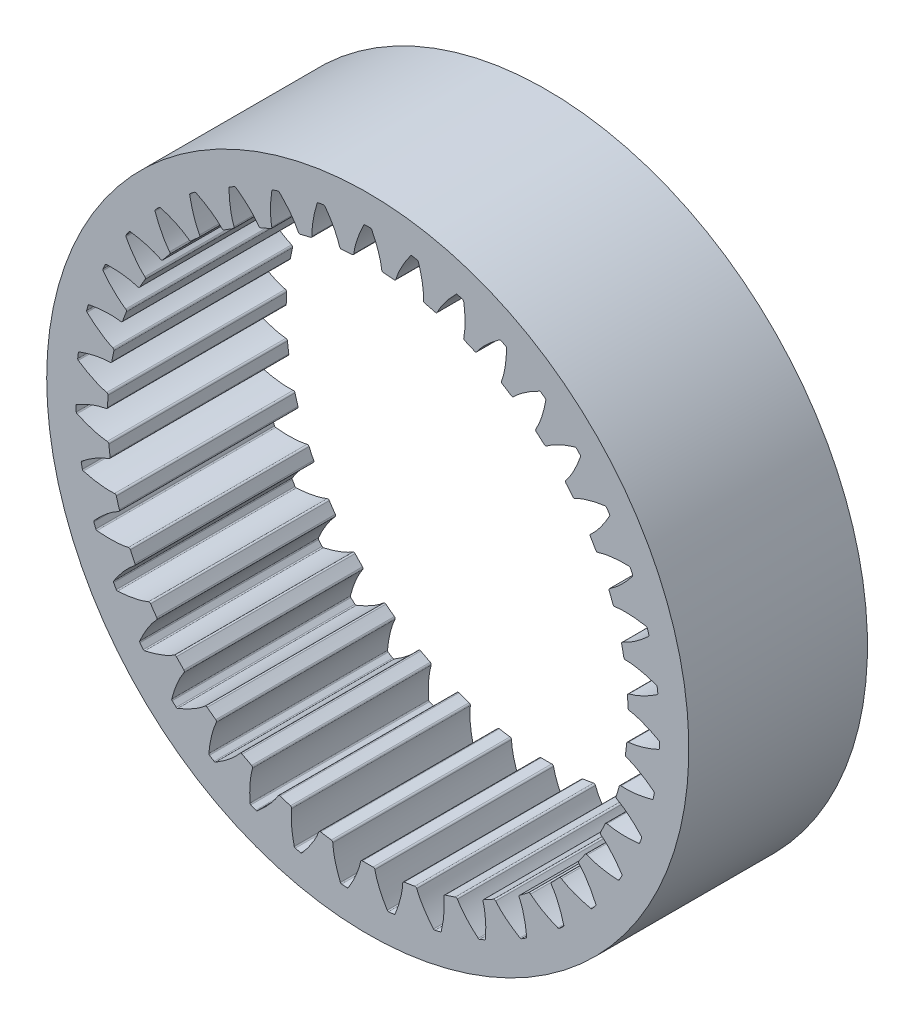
from build123d import *

# Parameters (mm, degrees)
SKETCH5_R              = 22.825
SKETCH5_R_2            = 18.5
RING_GEAR_BLANK_DEPTH  = 6.35
FIRST_TOOTH_DEPTH      = 33.898081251
TIP_RADIUS_R           = 0.125
ROOT_FILLET_R          = 0.1
TEETH_COUNT            = 39
TIP_RADIUS_OF_TEETH_R  = 0.125
ROOT_FILLET_OF_TEETH_R = 0.1


with BuildPart() as part:
    # Sketch5 → Ring Gear Blank (new, symmetric)
    with BuildSketch(Plane.XY):
        with Locations(Location((0, 0, 0), (0, 0, 180))):
            Circle(SKETCH5_R)
        with Locations(Location((0, 0, 0), (0, 0, 180))):
            Circle(SKETCH5_R_2, mode=Mode.SUBTRACT)
    extrude(amount=RING_GEAR_BLANK_DEPTH, both=True)

    # Sketch2 → First Tooth (cut, symmetric)
    with BuildSketch(Plane.XY):
        with BuildLine():
            ThreePointArc((0.254107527, 20.748444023), (0, 20.75), (-0.254107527, 20.748444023))
            add(Edge.make_bspline(
                [(-0.254107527, 20.748444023), (-0.310558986, 20.638981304), (-0.392132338, 20.473179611), (-0.494039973, 20.248906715), (-0.566854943, 20.079104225), (-0.635842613, 19.907709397), (-0.700758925, 19.734729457), (-0.76131836, 19.560173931), (-0.817179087, 19.384055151), (-0.867923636, 19.206390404), (-0.913013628, 19.027200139), (-0.951759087, 18.846525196), (-0.983058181, 18.664381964), (-1.005550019, 18.480971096), (-1.014718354, 18.296009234), (-0.999342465, 18.111683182), (-0.990543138, 17.927186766), (-0.979981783, 17.742735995), (-0.96989198, 17.558273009), (-0.81125654, 14.693390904), (-0.664745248, 11.889769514), (-0.505313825, 9.148057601)],
                knots=[0, 0, 0, 0, 0.031449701, 0.047174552, 0.062899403, 0.078624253, 0.094349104, 0.110073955, 0.125798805, 0.141523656, 0.157248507, 0.172973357, 0.188698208, 0.204423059, 0.220147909, 0.23587276, 0.251597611, 0.267322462, 0.283047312, 0.298772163, 1, 1, 1, 1], degree=3))
            ThreePointArc((-0.505313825, 9.148057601), (0, -9.162003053), (0.505313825, 9.148057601))
            add(Edge.make_bspline(
                [(0.254107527, 20.748444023), (0.310558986, 20.638981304), (0.392132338, 20.473179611), (0.494039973, 20.248906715), (0.566854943, 20.079104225), (0.635842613, 19.907709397), (0.700758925, 19.734729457), (0.76131836, 19.560173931), (0.817179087, 19.384055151), (0.867923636, 19.206390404), (0.913013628, 19.027200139), (0.951759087, 18.846525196), (0.983058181, 18.664381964), (1.005550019, 18.480971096), (1.014718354, 18.296009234), (0.999342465, 18.111683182), (0.990543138, 17.927186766), (0.979981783, 17.742735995), (0.96989198, 17.558273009), (0.81125654, 14.693390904), (0.664745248, 11.889769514), (0.505313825, 9.148057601)],
                knots=[0, 0, 0, 0, 0.031449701, 0.047174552, 0.062899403, 0.078624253, 0.094349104, 0.110073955, 0.125798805, 0.141523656, 0.157248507, 0.172973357, 0.188698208, 0.204423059, 0.220147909, 0.23587276, 0.251597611, 0.267322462, 0.283047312, 0.298772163, 1, 1, 1, 1], degree=3))
        make_face()
    first_tooth = extrude(amount=FIRST_TOOTH_DEPTH, both=True, mode=Mode.SUBTRACT)

    # Tip Radius
    tip_radius_edges = [part.edges().sort_by_distance(p)[0] for p in [
        (-1.004002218, 18.472736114, 3.175),
        (1.004002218, 18.472736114, 3.175),
    ]]
    fillet(tip_radius_edges, radius=TIP_RADIUS_R)

    # Root Fillet
    root_fillet_edges = [part.edges().sort_by_distance(p)[0] for p in [
        (-0.254107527, 20.748444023, 3.175),
        (0.254107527, 20.748444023, -3.175),
    ]]
    fillet(root_fillet_edges, radius=ROOT_FILLET_R)

    # Teeth: First Tooth ×39 about axis
    teeth_axis = Axis((0, 0, 6.35), (0, 0, -1))
    for i in range(1, TEETH_COUNT):
        add(first_tooth.rotate(teeth_axis, i * 360 / TEETH_COUNT), mode=Mode.SUBTRACT)

    # Tip Radius of Teeth
    tip_radius_of_teeth_edges = [part.edges().sort_by_distance(p)[0] for p in [
        (1.972234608, 18.394572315, 3.175),
        (3.954235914, 18.072465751, 3.175),
        (4.897391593, 17.839998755, 3.175),
        (6.802056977, 17.204128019, 3.175),
        (7.695708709, 16.823378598, 3.175),
        (9.473708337, 15.890212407, 3.175),
        (10.294711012, 15.371041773, 3.175),
        (11.899995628, 14.164748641, 3.175),
        (12.627085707, 13.520603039, 3.175),
        (14.018079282, 12.072425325, 3.175),
        (14.632425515, 11.319987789, 3.175),
        (15.773102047, 9.667432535, 3.175),
        (16.258793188, 8.826190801, 3.175),
        (17.119609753, 7.01205832, 3.175),
        (17.464066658, 6.103800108, 3.175),
        (18.02272856, 4.175075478, 3.175),
        (18.217029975, 3.223324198, 3.175),
        (18.459068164, 1.229960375, 3.175),
        (18.498181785, 0.259365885, 3.175),
        (18.417327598, -1.747010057, 3.175),
        (18.300240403, -2.711309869, 3.175),
        (17.898587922, -4.678733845, 3.175),
        (17.628332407, -5.611764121, 3.175),
        (16.91628422, -7.489280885, 3.175),
        (16.499859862, -8.366876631, 3.175),
        (15.495857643, -10.105859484, 3.175),
        (14.944049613, -10.90529143, 3.175),
        (13.674096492, -12.46070163, 3.175),
        (13.001196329, -13.16126491, 3.175),
        (11.498183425, -14.49281815, 3.175),
        (10.721618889, -15.076368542, 3.175),
        (9.024473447, -16.149578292, 3.175),
        (8.164357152, -16.601002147, 3.175),
        (6.317034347, -17.388072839, 3.175),
        (5.395642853, -17.695678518, 3.175),
        (3.445987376, -18.176225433, 3.175),
        (2.487184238, -18.33204611, 3.175),
        (0.485691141, -18.493623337, 3.175),
        (-0.485691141, -18.493623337, 3.175),
        (-2.487184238, -18.33204611, 3.175),
        (-3.445987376, -18.176225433, 3.175),
        (-5.395642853, -17.695678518, 3.175),
        (-6.317034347, -17.388072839, 3.175),
        (-8.164357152, -16.601002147, 3.175),
        (-9.024473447, -16.149578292, 3.175),
        (-10.721618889, -15.076368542, 3.175),
        (-11.498183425, -14.49281815, 3.175),
        (-13.001196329, -13.16126491, 3.175),
        (-13.674096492, -12.46070163, 3.175),
        (-14.944049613, -10.90529143, 3.175),
        (-15.495857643, -10.105859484, 3.175),
        (-16.499859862, -8.366876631, 3.175),
        (-16.91628422, -7.489280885, 3.175),
        (-17.628332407, -5.611764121, 3.175),
        (-17.898587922, -4.678733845, 3.175),
        (-18.300240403, -2.711309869, 3.175),
        (-18.417327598, -1.747010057, 3.175),
        (-18.498181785, 0.259365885, 3.175),
        (-18.459068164, 1.229960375, 3.175),
        (-18.217029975, 3.223324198, 3.175),
        (-18.02272856, 4.175075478, 3.175),
        (-17.464066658, 6.103800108, 3.175),
        (-17.119609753, 7.01205832, 3.175),
        (-16.258793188, 8.826190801, 3.175),
        (-15.773102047, 9.667432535, 3.175),
        (-14.632425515, 11.319987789, 3.175),
        (-14.018079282, 12.072425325, 3.175),
        (-12.627085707, 13.520603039, 3.175),
        (-11.899995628, 14.164748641, 3.175),
        (-10.294711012, 15.371041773, 3.175),
        (-9.473708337, 15.890212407, 3.175),
        (-7.695708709, 16.823378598, 3.175),
        (-6.802056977, 17.204128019, 3.175),
        (-4.897391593, 17.839998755, 3.175),
        (-3.954235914, 18.072465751, 3.175),
        (-1.972234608, 18.394572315, 3.175),
    ]]
    fillet(tip_radius_of_teeth_edges, radius=TIP_RADIUS_OF_TEETH_R)

    # Root Fillet of Teeth
    root_fillet_of_teeth_edges = [part.edges().sort_by_distance(p)[0] for p in [
        (3.077467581, 20.520518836, 3.175),
        (3.579101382, 20.438995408, -3.175),
        (6.329337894, 19.76112299, 3.175),
        (6.811398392, 19.600187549, -3.175),
        (9.417281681, 18.489924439, 3.175),
        (9.867283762, 18.253745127, -3.175),
        (12.261322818, 16.739846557, 3.175),
        (12.667611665, 16.434540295, -3.175),
        (14.787802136, 14.556215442, 3.175),
        (15.13985508, 14.189689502, -3.175),
        (16.931285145, 11.995585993, 3.175),
        (17.219984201, 11.577333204, -3.175),
        (18.636256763, 9.124277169, 3.175),
        (18.854124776, 8.665130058, -3.175),
        (19.85855912, 6.016654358, 3.175),
        (19.999953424, 5.528504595, -3.175),
        (20.566535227, 2.75320336, 3.175),
        (20.627793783, 2.248693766, -3.175),
        (20.741848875, -0.581554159, 3.175),
        (20.721385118, -1.089357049, -3.175),
        (20.379959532, -3.901249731, 3.175),
        (20.278303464, -4.39919409, -3.175),
        (19.490239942, -7.119904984, 3.175),
        (19.310024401, -7.595094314, -3.175),
        (18.095733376, -10.154158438, 3.175),
        (17.841625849, -10.594285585, -3.175),
        (16.23255682, -12.925424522, 3.175),
        (15.91113856, -13.319090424, -3.175),
        (13.94896557, -15.3619289, 3.175),
        (13.56856114, -15.698937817, -3.175),
        (11.304103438, -17.400567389, 3.175),
        (10.874565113, -17.672190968, -3.175),
        (8.366470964, -18.988540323, 3.175),
        (7.898923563, -19.187743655, -3.175),
        (5.212151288, -20.084720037, 3.175),
        (4.718704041, -20.20634386, -3.175),
        (1.922839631, -20.660716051, 3.175),
        (1.416272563, -20.701610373, -3.175),
        (-1.416272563, -20.701610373, 3.175),
        (-1.922839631, -20.660716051, -3.175),
        (-4.718704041, -20.20634386, 3.175),
        (-5.212151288, -20.084720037, -3.175),
        (-7.898923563, -19.187743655, 3.175),
        (-8.366470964, -18.988540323, -3.175),
        (-10.874565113, -17.672190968, 3.175),
        (-11.304103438, -17.400567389, -3.175),
        (-13.56856114, -15.698937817, 3.175),
        (-13.94896557, -15.3619289, -3.175),
        (-15.91113856, -13.319090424, 3.175),
        (-16.23255682, -12.925424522, -3.175),
        (-17.841625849, -10.594285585, 3.175),
        (-18.095733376, -10.154158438, -3.175),
        (-19.310024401, -7.595094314, 3.175),
        (-19.490239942, -7.119904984, -3.175),
        (-20.278303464, -4.39919409, 3.175),
        (-20.379959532, -3.901249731, -3.175),
        (-20.721385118, -1.089357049, 3.175),
        (-20.741848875, -0.581554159, -3.175),
        (-20.627793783, 2.248693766, 3.175),
        (-20.566535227, 2.75320336, -3.175),
        (-19.999953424, 5.528504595, 3.175),
        (-19.85855912, 6.016654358, -3.175),
        (-18.854124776, 8.665130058, 3.175),
        (-18.636256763, 9.124277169, -3.175),
        (-17.219984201, 11.577333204, 3.175),
        (-16.931285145, 11.995585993, -3.175),
        (-15.13985508, 14.189689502, 3.175),
        (-14.787802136, 14.556215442, -3.175),
        (-12.667611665, 16.434540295, 3.175),
        (-12.261322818, 16.739846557, -3.175),
        (-9.867283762, 18.253745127, 3.175),
        (-9.417281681, 18.489924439, -3.175),
        (-6.811398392, 19.600187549, 3.175),
        (-6.329337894, 19.76112299, -3.175),
        (-3.579101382, 20.438995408, 3.175),
        (-3.077467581, 20.520518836, -3.175),
    ]]
    fillet(root_fillet_of_teeth_edges, radius=ROOT_FILLET_OF_TEETH_R)


solid = part.part
